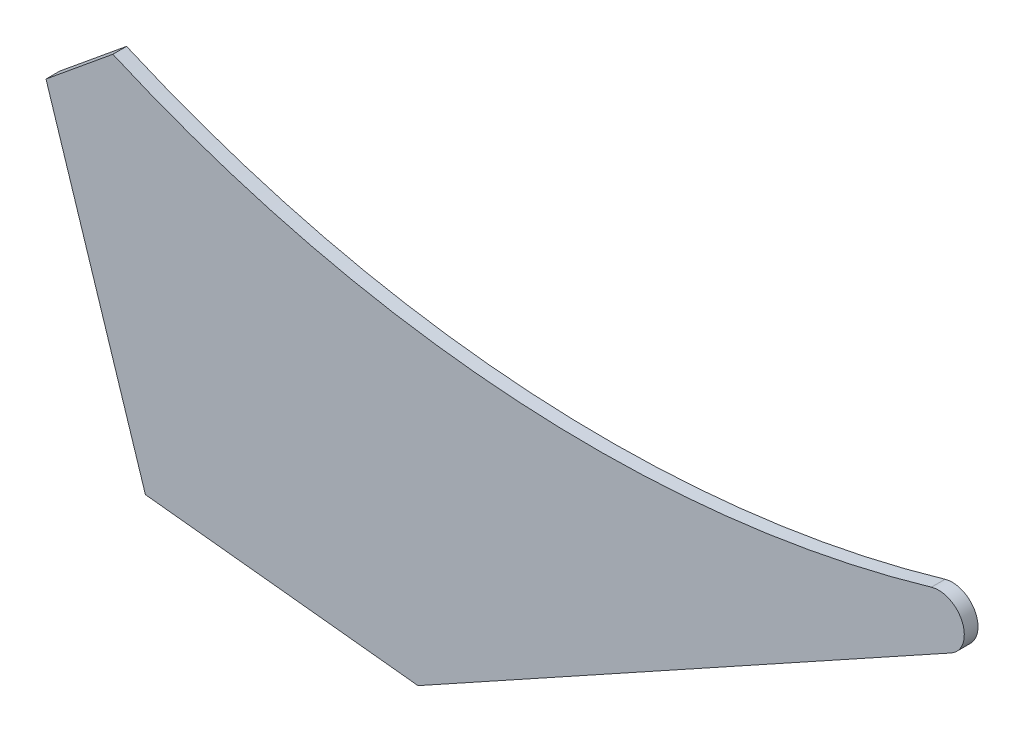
from build123d import *

# Parameters (mm, degrees)
EXTRUDE_1_DEPTH = 8


with BuildPart() as part:
    # Sketch 1 → Extrude 1 (new body)
    with BuildSketch(Plane.XY):
        with BuildLine():
            Line((0, 0), (-159, 17))
            Line((-159, 17), (-217, 198))
            Line((-217, 198), (-178, 230))
            ThreePointArc((-178, 230), (58.091620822, 172.818741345), (299.536679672, 199.525169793))
            ThreePointArc((299.536679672, 199.525169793), (317.587590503, 190.893144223), (311, 172))
            Line((311, 172), (0, 0))
        make_face()
    extrude(amount=EXTRUDE_1_DEPTH)


solid = part.part
